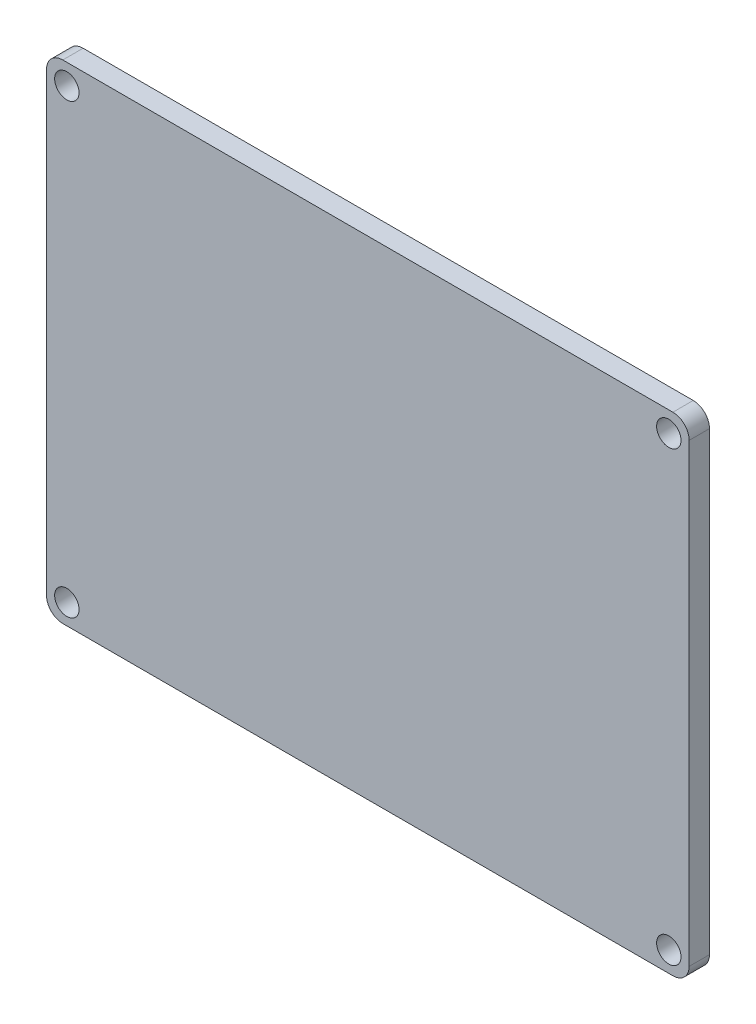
from build123d import *

# Parameters (mm, degrees)
SKETCH1_W           = 100.33
SKETCH1_H           = 76.2
SKETCH1_R           = 1.905
BOSS_EXTRUDE1_DEPTH = 3.175
FILLET1_R           = 2.54


with BuildPart() as part:
    # Sketch1 → Boss-Extrude1 (new body)
    with BuildSketch(Plane.XY):
        Rectangle(SKETCH1_W, SKETCH1_H)
        with Locations((-46.99, 34.925)):
            Circle(SKETCH1_R, mode=Mode.SUBTRACT)
        with Locations(Location((-46.99, -34.925, 0), (0, 0, 180))):
            Circle(SKETCH1_R, mode=Mode.SUBTRACT)
        with Locations((46.99, -34.925)):
            Circle(SKETCH1_R, mode=Mode.SUBTRACT)
        with Locations(Location((46.99, 34.925, 0), (0, 0, 180))):
            Circle(SKETCH1_R, mode=Mode.SUBTRACT)
    extrude(amount=BOSS_EXTRUDE1_DEPTH)

    # Fillet1
    fillet1_edges = [part.edges().sort_by_distance(p)[0] for p in [
        (50.165, -38.1, 1.5875),
        (-50.165, -38.1, 1.5875),
        (-50.165, 38.1, 1.5875),
        (50.165, 38.1, 1.5875),
    ]]
    fillet(fillet1_edges, radius=FILLET1_R)


solid = part.part
